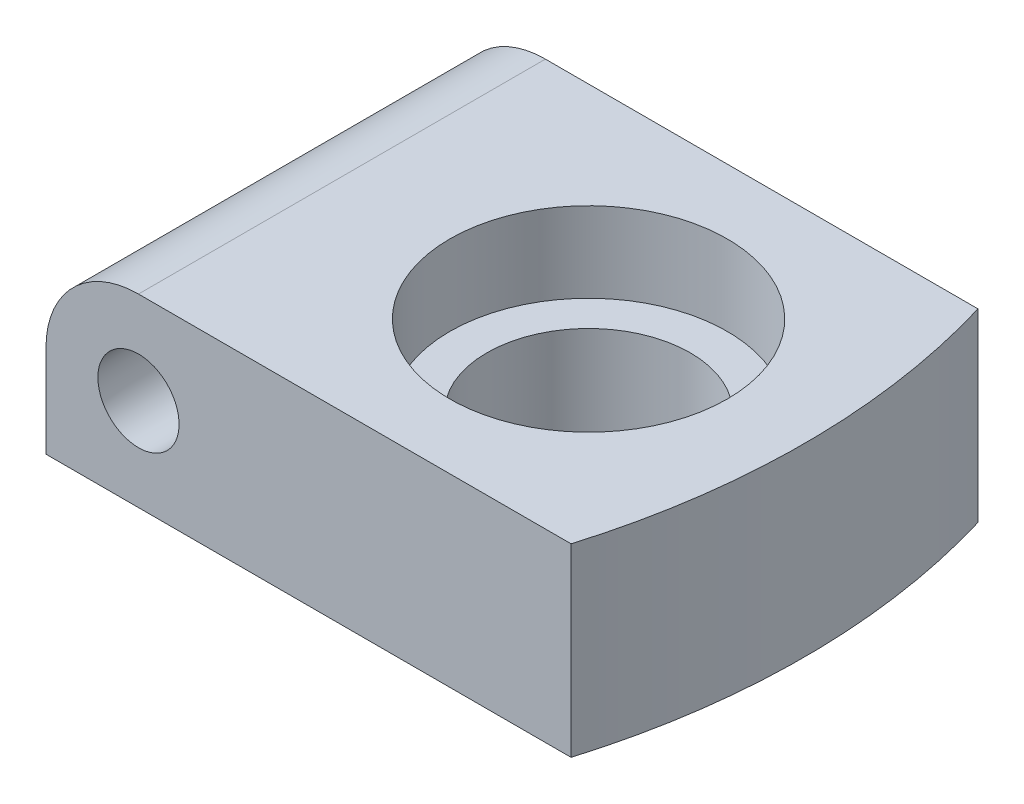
ISO-10303-21;
HEADER;
FILE_DESCRIPTION(('STEP AP214'),'2;1');
FILE_NAME('part.step','',(''),(''),'','','');
FILE_SCHEMA(('AUTOMOTIVE_DESIGN { 1 0 10303 214 1 1 1 1 }'));
ENDSEC;
DATA;
#1=APPLICATION_CONTEXT('core data for automotive mechanical design processes');
#2=APPLICATION_PROTOCOL_DEFINITION('international standard','automotive_design',2000,#1);
#3=PRODUCT_CONTEXT('',#1,'mechanical');
#4=PRODUCT('Part','Part','',(#3));
#5=PRODUCT_RELATED_PRODUCT_CATEGORY('part','',(#4));
#6=PRODUCT_DEFINITION_FORMATION('','',#4);
#7=PRODUCT_DEFINITION_CONTEXT('part definition',#1,'design');
#8=PRODUCT_DEFINITION('design','',#6,#7);
#9=PRODUCT_DEFINITION_SHAPE('','',#8);
#10=(LENGTH_UNIT() NAMED_UNIT(*) SI_UNIT(.MILLI.,.METRE.));
#11=(NAMED_UNIT(*) PLANE_ANGLE_UNIT() SI_UNIT($,.RADIAN.));
#12=(NAMED_UNIT(*) SI_UNIT($,.STERADIAN.) SOLID_ANGLE_UNIT());
#13=UNCERTAINTY_MEASURE_WITH_UNIT(LENGTH_MEASURE(1.E-05),#10,'distance_accuracy_value','');
#14=(GEOMETRIC_REPRESENTATION_CONTEXT(3) GLOBAL_UNCERTAINTY_ASSIGNED_CONTEXT((#13)) GLOBAL_UNIT_ASSIGNED_CONTEXT((#10,
#11,#12)) REPRESENTATION_CONTEXT('',''));
#15=CARTESIAN_POINT('',(0.,0.,0.));
#16=DIRECTION('',(0.,0.,1.));
#17=DIRECTION('',(1.,0.,0.));
#18=AXIS2_PLACEMENT_3D('',#15,#16,#17);
#19=CARTESIAN_POINT('',(-70.,30.,0.));
#20=DIRECTION('',(0.,-1.,0.));
#21=DIRECTION('',(0.,0.,-1.));
#22=AXIS2_PLACEMENT_3D('',#19,#20,#21);
#23=PLANE('',#22);
#24=DIRECTION('',(-1.,0.,0.));
#25=VECTOR('',#24,1.);
#26=CARTESIAN_POINT('',(-45.,30.,-33.));
#27=LINE('',#26,#25);
#28=CARTESIAN_POINT('',(40.1635148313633,30.,-33.));
#29=VERTEX_POINT('',#28);
#30=CARTESIAN_POINT('',(-30.,30.,-33.));
#31=VERTEX_POINT('',#30);
#32=EDGE_CURVE('E104',#29,#31,#27,.T.);
#33=ORIENTED_EDGE('',*,*,#32,.T.);
#34=DIRECTION('',(0.,0.,1.));
#35=VECTOR('',#34,1.);
#36=CARTESIAN_POINT('',(-30.,30.,0.));
#37=LINE('',#36,#35);
#38=CARTESIAN_POINT('',(-30.,30.,33.));
#39=VERTEX_POINT('',#38);
#40=EDGE_CURVE('E76',#31,#39,#37,.T.);
#41=ORIENTED_EDGE('',*,*,#40,.T.);
#42=DIRECTION('',(1.,0.,0.));
#43=VECTOR('',#42,1.);
#44=CARTESIAN_POINT('',(-45.,30.,33.));
#45=LINE('',#44,#43);
#46=CARTESIAN_POINT('',(40.1635148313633,30.,33.));
#47=VERTEX_POINT('',#46);
#48=EDGE_CURVE('E100',#39,#47,#45,.T.);
#49=ORIENTED_EDGE('',*,*,#48,.T.);
#50=CARTESIAN_POINT('',(-70.,30.,0.));
#51=DIRECTION('',(0.,1.,0.));
#52=DIRECTION('',(0.,0.,-1.));
#53=AXIS2_PLACEMENT_3D('',#50,#51,#52);
#54=CIRCLE('',#53,115.);
#55=EDGE_CURVE('E102',#47,#29,#54,.T.);
#56=ORIENTED_EDGE('',*,*,#55,.T.);
#57=EDGE_LOOP('',(#33,#41,#49,#56));
#58=FACE_BOUND('',#57,.T.);
#59=CARTESIAN_POINT('',(9.99999999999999,30.,0.));
#60=DIRECTION('',(0.,1.,0.));
#61=DIRECTION('',(-1.,0.,0.));
#62=AXIS2_PLACEMENT_3D('',#59,#60,#61);
#63=CIRCLE('',#62,22.5);
#64=CARTESIAN_POINT('',(-12.5,30.,0.));
#65=VERTEX_POINT('',#64);
#66=EDGE_CURVE('E90',#65,#65,#63,.T.);
#67=ORIENTED_EDGE('',*,*,#66,.F.);
#68=EDGE_LOOP('',(#67));
#69=FACE_BOUND('',#68,.T.);
#70=ADVANCED_FACE('F26',(#58,#69),#23,.F.);
#71=CARTESIAN_POINT('',(-70.,0.,0.));
#72=DIRECTION('',(0.,-1.,0.));
#73=DIRECTION('',(0.,0.,-1.));
#74=AXIS2_PLACEMENT_3D('',#71,#72,#73);
#75=PLANE('',#74);
#76=DIRECTION('',(0.,0.,1.));
#77=VECTOR('',#76,1.);
#78=CARTESIAN_POINT('',(-45.,0.,33.));
#79=LINE('',#78,#77);
#80=CARTESIAN_POINT('',(-45.,0.,-33.));
#81=VERTEX_POINT('',#80);
#82=CARTESIAN_POINT('',(-45.,0.,33.));
#83=VERTEX_POINT('',#82);
#84=EDGE_CURVE('E85',#81,#83,#79,.T.);
#85=ORIENTED_EDGE('',*,*,#84,.F.);
#86=DIRECTION('',(-1.,0.,0.));
#87=VECTOR('',#86,1.);
#88=CARTESIAN_POINT('',(-45.,0.,-33.));
#89=LINE('',#88,#87);
#90=CARTESIAN_POINT('',(40.1635148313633,0.,-33.));
#91=VERTEX_POINT('',#90);
#92=EDGE_CURVE('E98',#91,#81,#89,.T.);
#93=ORIENTED_EDGE('',*,*,#92,.F.);
#94=CARTESIAN_POINT('',(-70.,0.,0.));
#95=DIRECTION('',(0.,1.,0.));
#96=DIRECTION('',(0.,0.,-1.));
#97=AXIS2_PLACEMENT_3D('',#94,#95,#96);
#98=CIRCLE('',#97,115.);
#99=CARTESIAN_POINT('',(40.1635148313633,0.,33.));
#100=VERTEX_POINT('',#99);
#101=EDGE_CURVE('E86',#100,#91,#98,.T.);
#102=ORIENTED_EDGE('',*,*,#101,.F.);
#103=DIRECTION('',(1.,0.,0.));
#104=VECTOR('',#103,1.);
#105=CARTESIAN_POINT('',(-45.,0.,33.));
#106=LINE('',#105,#104);
#107=EDGE_CURVE('E73',#83,#100,#106,.T.);
#108=ORIENTED_EDGE('',*,*,#107,.F.);
#109=EDGE_LOOP('',(#85,#93,#102,#108));
#110=FACE_BOUND('',#109,.T.);
#111=CARTESIAN_POINT('',(9.99999999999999,0.,0.));
#112=DIRECTION('',(0.,1.,0.));
#113=DIRECTION('',(-1.,0.,0.));
#114=AXIS2_PLACEMENT_3D('',#111,#112,#113);
#115=CIRCLE('',#114,16.5);
#116=CARTESIAN_POINT('',(-6.50000000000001,0.,0.));
#117=VERTEX_POINT('',#116);
#118=EDGE_CURVE('E158',#117,#117,#115,.T.);
#119=ORIENTED_EDGE('',*,*,#118,.T.);
#120=EDGE_LOOP('',(#119));
#121=FACE_BOUND('',#120,.T.);
#122=ADVANCED_FACE('F82',(#110,#121),#75,.T.);
#123=CARTESIAN_POINT('',(-45.,30.,33.));
#124=DIRECTION('',(1.,0.,0.));
#125=DIRECTION('',(0.,0.,-1.));
#126=AXIS2_PLACEMENT_3D('',#123,#124,#125);
#127=PLANE('',#126);
#128=DIRECTION('',(0.,-1.,0.));
#129=VECTOR('',#128,1.);
#130=CARTESIAN_POINT('',(-45.,30.,33.));
#131=LINE('',#130,#129);
#132=CARTESIAN_POINT('',(-45.,15.,33.));
#133=VERTEX_POINT('',#132);
#134=EDGE_CURVE('E69',#133,#83,#131,.T.);
#135=ORIENTED_EDGE('',*,*,#134,.F.);
#136=DIRECTION('',(0.,0.,1.));
#137=VECTOR('',#136,1.);
#138=CARTESIAN_POINT('',(-45.,15.,33.));
#139=LINE('',#138,#137);
#140=CARTESIAN_POINT('',(-45.,15.,-33.));
#141=VERTEX_POINT('',#140);
#142=EDGE_CURVE('E35',#133,#141,#139,.F.);
#143=ORIENTED_EDGE('',*,*,#142,.T.);
#144=DIRECTION('',(0.,-1.,0.));
#145=VECTOR('',#144,1.);
#146=CARTESIAN_POINT('',(-45.,30.,-33.));
#147=LINE('',#146,#145);
#148=EDGE_CURVE('E88',#141,#81,#147,.T.);
#149=ORIENTED_EDGE('',*,*,#148,.T.);
#150=ORIENTED_EDGE('',*,*,#84,.T.);
#151=EDGE_LOOP('',(#135,#143,#149,#150));
#152=FACE_BOUND('',#151,.T.);
#153=ADVANCED_FACE('F28',(#152),#127,.F.);
#154=CARTESIAN_POINT('',(-45.,30.,33.));
#155=DIRECTION('',(0.,0.,-1.));
#156=DIRECTION('',(-1.,0.,0.));
#157=AXIS2_PLACEMENT_3D('',#154,#155,#156);
#158=PLANE('',#157);
#159=CARTESIAN_POINT('',(-30.,15.,33.));
#160=DIRECTION('',(0.,0.,-1.));
#161=DIRECTION('',(-1.,0.,0.));
#162=AXIS2_PLACEMENT_3D('',#159,#160,#161);
#163=CIRCLE('',#162,6.585);
#164=CARTESIAN_POINT('',(-36.585,15.,33.));
#165=VERTEX_POINT('',#164);
#166=EDGE_CURVE('E156',#165,#165,#163,.T.);
#167=ORIENTED_EDGE('',*,*,#166,.T.);
#168=EDGE_LOOP('',(#167));
#169=FACE_BOUND('',#168,.T.);
#170=ORIENTED_EDGE('',*,*,#48,.F.);
#171=CARTESIAN_POINT('',(-30.,15.,33.));
#172=DIRECTION('',(0.,0.,-1.));
#173=DIRECTION('',(-1.,0.,0.));
#174=AXIS2_PLACEMENT_3D('',#171,#172,#173);
#175=CIRCLE('',#174,15.);
#176=EDGE_CURVE('E49',#39,#133,#175,.F.);
#177=ORIENTED_EDGE('',*,*,#176,.T.);
#178=ORIENTED_EDGE('',*,*,#134,.T.);
#179=ORIENTED_EDGE('',*,*,#107,.T.);
#180=DIRECTION('',(0.,-1.,0.));
#181=VECTOR('',#180,1.);
#182=CARTESIAN_POINT('',(40.1635148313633,30.,33.));
#183=LINE('',#182,#181);
#184=EDGE_CURVE('E77',#47,#100,#183,.T.);
#185=ORIENTED_EDGE('',*,*,#184,.F.);
#186=EDGE_LOOP('',(#170,#177,#178,#179,#185));
#187=FACE_BOUND('',#186,.T.);
#188=ADVANCED_FACE('F71',(#169,#187),#158,.F.);
#189=CARTESIAN_POINT('',(-70.,30.,0.));
#190=DIRECTION('',(0.,-1.,0.));
#191=DIRECTION('',(0.,0.,-1.));
#192=AXIS2_PLACEMENT_3D('',#189,#190,#191);
#193=CYLINDRICAL_SURFACE('',#192,115.);
#194=ORIENTED_EDGE('',*,*,#101,.T.);
#195=DIRECTION('',(0.,-1.,0.));
#196=VECTOR('',#195,1.);
#197=CARTESIAN_POINT('',(40.1635148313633,30.,-33.));
#198=LINE('',#197,#196);
#199=EDGE_CURVE('E108',#29,#91,#198,.T.);
#200=ORIENTED_EDGE('',*,*,#199,.F.);
#201=ORIENTED_EDGE('',*,*,#55,.F.);
#202=ORIENTED_EDGE('',*,*,#184,.T.);
#203=EDGE_LOOP('',(#194,#200,#201,#202));
#204=FACE_BOUND('',#203,.T.);
#205=ADVANCED_FACE('F124',(#204),#193,.T.);
#206=CARTESIAN_POINT('',(-45.,30.,-33.));
#207=DIRECTION('',(0.,0.,1.));
#208=DIRECTION('',(1.,0.,0.));
#209=AXIS2_PLACEMENT_3D('',#206,#207,#208);
#210=PLANE('',#209);
#211=CARTESIAN_POINT('',(-30.,15.,-33.));
#212=DIRECTION('',(0.,0.,1.));
#213=DIRECTION('',(1.,0.,0.));
#214=AXIS2_PLACEMENT_3D('',#211,#212,#213);
#215=CIRCLE('',#214,6.915);
#216=CARTESIAN_POINT('',(-23.085,15.,-33.));
#217=VERTEX_POINT('',#216);
#218=EDGE_CURVE('E30',#217,#217,#215,.T.);
#219=ORIENTED_EDGE('',*,*,#218,.T.);
#220=EDGE_LOOP('',(#219));
#221=FACE_BOUND('',#220,.T.);
#222=ORIENTED_EDGE('',*,*,#148,.F.);
#223=CARTESIAN_POINT('',(-30.,15.,-33.));
#224=DIRECTION('',(0.,0.,1.));
#225=DIRECTION('',(1.,0.,0.));
#226=AXIS2_PLACEMENT_3D('',#223,#224,#225);
#227=CIRCLE('',#226,15.);
#228=EDGE_CURVE('E11',#141,#31,#227,.F.);
#229=ORIENTED_EDGE('',*,*,#228,.T.);
#230=ORIENTED_EDGE('',*,*,#32,.F.);
#231=ORIENTED_EDGE('',*,*,#199,.T.);
#232=ORIENTED_EDGE('',*,*,#92,.T.);
#233=EDGE_LOOP('',(#222,#229,#230,#231,#232));
#234=FACE_BOUND('',#233,.T.);
#235=ADVANCED_FACE('F126',(#221,#234),#210,.F.);
#236=CARTESIAN_POINT('',(-30.,15.,0.));
#237=DIRECTION('',(0.,0.,1.));
#238=DIRECTION('',(1.,0.,0.));
#239=AXIS2_PLACEMENT_3D('',#236,#237,#238);
#240=CYLINDRICAL_SURFACE('',#239,15.);
#241=ORIENTED_EDGE('',*,*,#228,.F.);
#242=ORIENTED_EDGE('',*,*,#142,.F.);
#243=ORIENTED_EDGE('',*,*,#176,.F.);
#244=ORIENTED_EDGE('',*,*,#40,.F.);
#245=EDGE_LOOP('',(#241,#242,#243,#244));
#246=FACE_BOUND('',#245,.T.);
#247=ADVANCED_FACE('F127',(#246),#240,.T.);
#248=CARTESIAN_POINT('',(9.99999999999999,33.2730923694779,0.));
#249=DIRECTION('',(0.,1.,0.));
#250=DIRECTION('',(-1.,0.,0.));
#251=AXIS2_PLACEMENT_3D('',#248,#249,#250);
#252=CYLINDRICAL_SURFACE('',#251,22.5);
#253=ORIENTED_EDGE('',*,*,#66,.T.);
#254=EDGE_LOOP('',(#253));
#255=FACE_BOUND('',#254,.T.);
#256=CARTESIAN_POINT('',(9.99999999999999,17.,0.));
#257=DIRECTION('',(0.,1.,0.));
#258=DIRECTION('',(-1.,0.,0.));
#259=AXIS2_PLACEMENT_3D('',#256,#257,#258);
#260=CIRCLE('',#259,22.5);
#261=CARTESIAN_POINT('',(-12.5,17.,0.));
#262=VERTEX_POINT('',#261);
#263=EDGE_CURVE('E93',#262,#262,#260,.T.);
#264=ORIENTED_EDGE('',*,*,#263,.F.);
#265=EDGE_LOOP('',(#264));
#266=FACE_BOUND('',#265,.T.);
#267=ADVANCED_FACE('F129',(#255,#266),#252,.F.);
#268=CARTESIAN_POINT('',(32.5,17.,0.));
#269=DIRECTION('',(0.,1.,0.));
#270=DIRECTION('',(-1.,0.,0.));
#271=AXIS2_PLACEMENT_3D('',#268,#269,#270);
#272=PLANE('',#271);
#273=ORIENTED_EDGE('',*,*,#263,.T.);
#274=EDGE_LOOP('',(#273));
#275=FACE_BOUND('',#274,.T.);
#276=CARTESIAN_POINT('',(9.99999999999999,17.,0.));
#277=DIRECTION('',(0.,1.,0.));
#278=DIRECTION('',(-1.,0.,0.));
#279=AXIS2_PLACEMENT_3D('',#276,#277,#278);
#280=CIRCLE('',#279,16.5);
#281=CARTESIAN_POINT('',(-6.50000000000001,17.,0.));
#282=VERTEX_POINT('',#281);
#283=EDGE_CURVE('E161',#282,#282,#280,.T.);
#284=ORIENTED_EDGE('',*,*,#283,.F.);
#285=EDGE_LOOP('',(#284));
#286=FACE_BOUND('',#285,.T.);
#287=ADVANCED_FACE('F136',(#275,#286),#272,.T.);
#288=CARTESIAN_POINT('',(9.99999999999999,33.2730923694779,0.));
#289=DIRECTION('',(0.,1.,0.));
#290=DIRECTION('',(-1.,0.,0.));
#291=AXIS2_PLACEMENT_3D('',#288,#289,#290);
#292=CYLINDRICAL_SURFACE('',#291,16.5);
#293=ORIENTED_EDGE('',*,*,#283,.T.);
#294=EDGE_LOOP('',(#293));
#295=FACE_BOUND('',#294,.T.);
#296=ORIENTED_EDGE('',*,*,#118,.F.);
#297=EDGE_LOOP('',(#296));
#298=FACE_BOUND('',#297,.T.);
#299=ADVANCED_FACE('F172',(#295,#298),#292,.F.);
#300=CARTESIAN_POINT('',(-30.,15.,50.));
#301=DIRECTION('',(0.,0.,-1.));
#302=DIRECTION('',(-1.,0.,0.));
#303=AXIS2_PLACEMENT_3D('',#300,#301,#302);
#304=CONICAL_SURFACE('',#303,6.5,0.00499995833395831);
#305=ORIENTED_EDGE('',*,*,#218,.F.);
#306=EDGE_LOOP('',(#305));
#307=FACE_BOUND('',#306,.T.);
#308=ORIENTED_EDGE('',*,*,#166,.F.);
#309=EDGE_LOOP('',(#308));
#310=FACE_BOUND('',#309,.T.);
#311=ADVANCED_FACE('F177',(#307,#310),#304,.F.);
#312=CLOSED_SHELL('',(#70,#122,#153,#188,#205,#235,#247,#267,#287,#299,#311));
#313=MANIFOLD_SOLID_BREP('B2',#312);
#314=ADVANCED_BREP_SHAPE_REPRESENTATION('',(#18,#313),#14);
#315=SHAPE_DEFINITION_REPRESENTATION(#9,#314);
ENDSEC;
END-ISO-10303-21;
